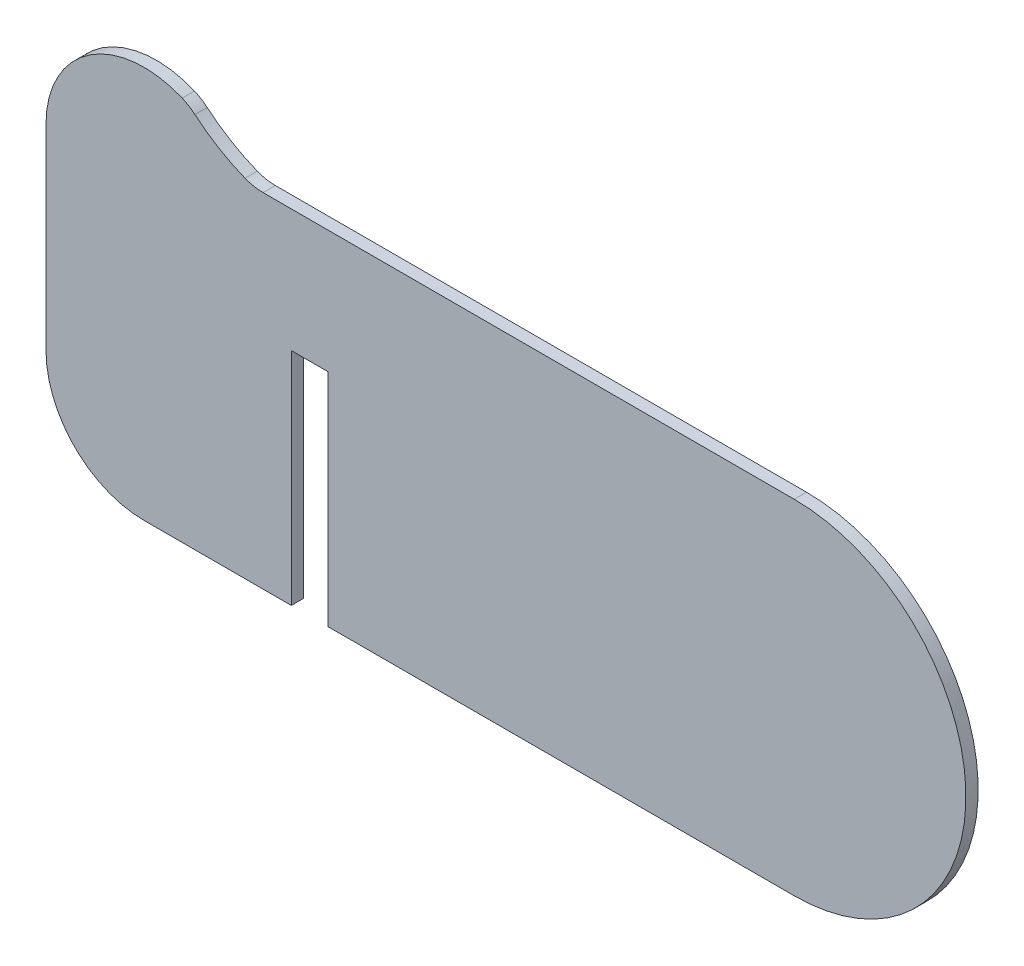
ISO-10303-21;
HEADER;
FILE_DESCRIPTION(('STEP AP214'),'2;1');
FILE_NAME('part.step','',(''),(''),'','','');
FILE_SCHEMA(('AUTOMOTIVE_DESIGN { 1 0 10303 214 1 1 1 1 }'));
ENDSEC;
DATA;
#1=APPLICATION_CONTEXT('core data for automotive mechanical design processes');
#2=APPLICATION_PROTOCOL_DEFINITION('international standard','automotive_design',2000,#1);
#3=PRODUCT_CONTEXT('',#1,'mechanical');
#4=PRODUCT('Part','Part','',(#3));
#5=PRODUCT_RELATED_PRODUCT_CATEGORY('part','',(#4));
#6=PRODUCT_DEFINITION_FORMATION('','',#4);
#7=PRODUCT_DEFINITION_CONTEXT('part definition',#1,'design');
#8=PRODUCT_DEFINITION('design','',#6,#7);
#9=PRODUCT_DEFINITION_SHAPE('','',#8);
#10=(LENGTH_UNIT() NAMED_UNIT(*) SI_UNIT(.MILLI.,.METRE.));
#11=(NAMED_UNIT(*) PLANE_ANGLE_UNIT() SI_UNIT($,.RADIAN.));
#12=(NAMED_UNIT(*) SI_UNIT($,.STERADIAN.) SOLID_ANGLE_UNIT());
#13=UNCERTAINTY_MEASURE_WITH_UNIT(LENGTH_MEASURE(1.E-05),#10,'distance_accuracy_value','');
#14=(GEOMETRIC_REPRESENTATION_CONTEXT(3) GLOBAL_UNCERTAINTY_ASSIGNED_CONTEXT((#13)) GLOBAL_UNIT_ASSIGNED_CONTEXT((#10,
#11,#12)) REPRESENTATION_CONTEXT('',''));
#15=CARTESIAN_POINT('',(0.,0.,0.));
#16=DIRECTION('',(0.,0.,1.));
#17=DIRECTION('',(1.,0.,0.));
#18=AXIS2_PLACEMENT_3D('',#15,#16,#17);
#19=CARTESIAN_POINT('',(-26.5,-2.,0.));
#20=DIRECTION('',(0.,0.,1.));
#21=DIRECTION('',(1.,0.,0.));
#22=AXIS2_PLACEMENT_3D('',#19,#20,#21);
#23=PLANE('',#22);
#24=DIRECTION('',(0.,1.,0.));
#25=VECTOR('',#24,1.);
#26=CARTESIAN_POINT('',(-19.,-5.,0.));
#27=LINE('',#26,#25);
#28=CARTESIAN_POINT('',(-19.,-14.,0.));
#29=VERTEX_POINT('',#28);
#30=CARTESIAN_POINT('',(-19.,-5.,0.));
#31=VERTEX_POINT('',#30);
#32=EDGE_CURVE('E156',#29,#31,#27,.T.);
#33=ORIENTED_EDGE('',*,*,#32,.T.);
#34=DIRECTION('',(1.,0.,0.));
#35=VECTOR('',#34,1.);
#36=CARTESIAN_POINT('',(-26.5,-5.,0.));
#37=LINE('',#36,#35);
#38=CARTESIAN_POINT('',(-20.5,-5.,0.));
#39=VERTEX_POINT('',#38);
#40=EDGE_CURVE('E158',#39,#31,#37,.T.);
#41=ORIENTED_EDGE('',*,*,#40,.F.);
#42=DIRECTION('',(0.,1.,0.));
#43=VECTOR('',#42,1.);
#44=CARTESIAN_POINT('',(-20.5,-5.,0.));
#45=LINE('',#44,#43);
#46=CARTESIAN_POINT('',(-20.5,-14.,0.));
#47=VERTEX_POINT('',#46);
#48=EDGE_CURVE('E164',#39,#47,#45,.F.);
#49=ORIENTED_EDGE('',*,*,#48,.T.);
#50=DIRECTION('',(-1.,0.,0.));
#51=VECTOR('',#50,1.);
#52=CARTESIAN_POINT('',(-26.5,-14.,0.));
#53=LINE('',#52,#51);
#54=CARTESIAN_POINT('',(-26.5,-14.,0.));
#55=VERTEX_POINT('',#54);
#56=EDGE_CURVE('E161',#47,#55,#53,.T.);
#57=ORIENTED_EDGE('',*,*,#56,.T.);
#58=CARTESIAN_POINT('',(-26.5,-10.,0.));
#59=DIRECTION('',(0.,0.,-1.));
#60=DIRECTION('',(-1.,0.,0.));
#61=AXIS2_PLACEMENT_3D('',#58,#59,#60);
#62=CIRCLE('',#61,4.);
#63=CARTESIAN_POINT('',(-30.5,-10.,0.));
#64=VERTEX_POINT('',#63);
#65=EDGE_CURVE('E179',#64,#55,#62,.F.);
#66=ORIENTED_EDGE('',*,*,#65,.F.);
#67=DIRECTION('',(0.,1.,0.));
#68=VECTOR('',#67,1.);
#69=CARTESIAN_POINT('',(-30.5,-2.,0.));
#70=LINE('',#69,#68);
#71=CARTESIAN_POINT('',(-30.5,-2.,0.));
#72=VERTEX_POINT('',#71);
#73=EDGE_CURVE('E177',#64,#72,#70,.T.);
#74=ORIENTED_EDGE('',*,*,#73,.T.);
#75=CARTESIAN_POINT('',(-26.5,-2.,0.));
#76=DIRECTION('',(0.,0.,-1.));
#77=DIRECTION('',(-1.,0.,0.));
#78=AXIS2_PLACEMENT_3D('',#75,#76,#77);
#79=CIRCLE('',#78,4.);
#80=CARTESIAN_POINT('',(-24.9499170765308,1.68744395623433,0.));
#81=VERTEX_POINT('',#80);
#82=EDGE_CURVE('E206',#81,#72,#79,.F.);
#83=ORIENTED_EDGE('',*,*,#82,.F.);
#84=CARTESIAN_POINT('',(-25.7249585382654,-0.156278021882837,0.));
#85=DIRECTION('',(0.,0.,-1.));
#86=DIRECTION('',(-1.,0.,0.));
#87=AXIS2_PLACEMENT_3D('',#84,#85,#86);
#88=CIRCLE('',#87,2.);
#89=CARTESIAN_POINT('',(-24.4292685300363,1.36726633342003,0.));
#90=VERTEX_POINT('',#89);
#91=EDGE_CURVE('E210',#90,#81,#88,.F.);
#92=ORIENTED_EDGE('',*,*,#91,.F.);
#93=CARTESIAN_POINT('',(-19.7,6.92820323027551,0.));
#94=DIRECTION('',(0.,0.,-1.));
#95=DIRECTION('',(-1.,0.,0.));
#96=AXIS2_PLACEMENT_3D('',#93,#94,#95);
#97=CIRCLE('',#96,7.3);
#98=CARTESIAN_POINT('',(-22.385959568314,0.140300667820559,0.));
#99=VERTEX_POINT('',#98);
#100=EDGE_CURVE('E213',#90,#99,#97,.F.);
#101=ORIENTED_EDGE('',*,*,#100,.T.);
#102=CARTESIAN_POINT('',(-21.6500802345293,2.,0.));
#103=DIRECTION('',(0.,0.,-1.));
#104=DIRECTION('',(-1.,0.,0.));
#105=AXIS2_PLACEMENT_3D('',#102,#103,#104);
#106=CIRCLE('',#105,2.);
#107=CARTESIAN_POINT('',(-21.6500802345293,0.,0.));
#108=VERTEX_POINT('',#107);
#109=EDGE_CURVE('E124',#99,#108,#106,.F.);
#110=ORIENTED_EDGE('',*,*,#109,.T.);
#111=DIRECTION('',(1.,0.,0.));
#112=VECTOR('',#111,1.);
#113=CARTESIAN_POINT('',(0.,0.,0.));
#114=LINE('',#113,#112);
#115=CARTESIAN_POINT('',(0.,0.,0.));
#116=VERTEX_POINT('',#115);
#117=EDGE_CURVE('E121',#108,#116,#114,.T.);
#118=ORIENTED_EDGE('',*,*,#117,.T.);
#119=CARTESIAN_POINT('',(0.,-7.,0.));
#120=DIRECTION('',(0.,0.,-1.));
#121=DIRECTION('',(-1.,0.,0.));
#122=AXIS2_PLACEMENT_3D('',#119,#120,#121);
#123=CIRCLE('',#122,7.);
#124=CARTESIAN_POINT('',(0.,-14.,0.));
#125=VERTEX_POINT('',#124);
#126=EDGE_CURVE('E20',#125,#116,#123,.F.);
#127=ORIENTED_EDGE('',*,*,#126,.F.);
#128=DIRECTION('',(-1.,0.,0.));
#129=VECTOR('',#128,1.);
#130=CARTESIAN_POINT('',(-26.5,-14.,0.));
#131=LINE('',#130,#129);
#132=EDGE_CURVE('E139',#125,#29,#131,.T.);
#133=ORIENTED_EDGE('',*,*,#132,.T.);
#134=EDGE_LOOP('',(#33,#41,#49,#57,#66,#74,#83,#92,#101,#110,#118,#127,#133));
#135=FACE_BOUND('',#134,.T.);
#136=ADVANCED_FACE('F17',(#135),#23,.F.);
#137=CARTESIAN_POINT('',(-19.,-5.,0.));
#138=DIRECTION('',(1.,0.,0.));
#139=DIRECTION('',(0.,0.,-1.));
#140=AXIS2_PLACEMENT_3D('',#137,#138,#139);
#141=PLANE('',#140);
#142=DIRECTION('',(0.,0.,1.));
#143=VECTOR('',#142,1.);
#144=CARTESIAN_POINT('',(-19.,-5.,0.));
#145=LINE('',#144,#143);
#146=CARTESIAN_POINT('',(-19.,-5.,0.5));
#147=VERTEX_POINT('',#146);
#148=EDGE_CURVE('E148',#147,#31,#145,.F.);
#149=ORIENTED_EDGE('',*,*,#148,.T.);
#150=ORIENTED_EDGE('',*,*,#32,.F.);
#151=DIRECTION('',(0.,0.,1.));
#152=VECTOR('',#151,1.);
#153=CARTESIAN_POINT('',(-19.,-14.,0.5));
#154=LINE('',#153,#152);
#155=CARTESIAN_POINT('',(-19.,-14.,0.5));
#156=VERTEX_POINT('',#155);
#157=EDGE_CURVE('E119',#29,#156,#154,.T.);
#158=ORIENTED_EDGE('',*,*,#157,.T.);
#159=DIRECTION('',(0.,1.,0.));
#160=VECTOR('',#159,1.);
#161=CARTESIAN_POINT('',(-19.,-2.,0.5));
#162=LINE('',#161,#160);
#163=EDGE_CURVE('E142',#147,#156,#162,.F.);
#164=ORIENTED_EDGE('',*,*,#163,.F.);
#165=EDGE_LOOP('',(#149,#150,#158,#164));
#166=FACE_BOUND('',#165,.T.);
#167=ADVANCED_FACE('F277',(#166),#141,.F.);
#168=CARTESIAN_POINT('',(-26.5,-14.,0.5));
#169=DIRECTION('',(0.,1.,0.));
#170=DIRECTION('',(-1.,0.,0.));
#171=AXIS2_PLACEMENT_3D('',#168,#169,#170);
#172=PLANE('',#171);
#173=ORIENTED_EDGE('',*,*,#157,.F.);
#174=ORIENTED_EDGE('',*,*,#132,.F.);
#175=DIRECTION('',(0.,0.,-1.));
#176=VECTOR('',#175,1.);
#177=CARTESIAN_POINT('',(0.,-14.,0.5));
#178=LINE('',#177,#176);
#179=CARTESIAN_POINT('',(0.,-14.,0.5));
#180=VERTEX_POINT('',#179);
#181=EDGE_CURVE('E118',#180,#125,#178,.T.);
#182=ORIENTED_EDGE('',*,*,#181,.F.);
#183=DIRECTION('',(1.,0.,0.));
#184=VECTOR('',#183,1.);
#185=CARTESIAN_POINT('',(-26.5,-14.,0.5));
#186=LINE('',#185,#184);
#187=EDGE_CURVE('E145',#156,#180,#186,.T.);
#188=ORIENTED_EDGE('',*,*,#187,.F.);
#189=EDGE_LOOP('',(#173,#174,#182,#188));
#190=FACE_BOUND('',#189,.T.);
#191=ADVANCED_FACE('F281',(#190),#172,.F.);
#192=CARTESIAN_POINT('',(0.,-7.,0.5));
#193=DIRECTION('',(0.,0.,-1.));
#194=DIRECTION('',(-1.,0.,0.));
#195=AXIS2_PLACEMENT_3D('',#192,#193,#194);
#196=CYLINDRICAL_SURFACE('',#195,7.);
#197=CARTESIAN_POINT('',(0.,-7.,0.5));
#198=DIRECTION('',(0.,0.,-1.));
#199=DIRECTION('',(-1.,0.,0.));
#200=AXIS2_PLACEMENT_3D('',#197,#198,#199);
#201=CIRCLE('',#200,7.);
#202=CARTESIAN_POINT('',(0.,0.,0.5));
#203=VERTEX_POINT('',#202);
#204=EDGE_CURVE('E202',#180,#203,#201,.F.);
#205=ORIENTED_EDGE('',*,*,#204,.F.);
#206=ORIENTED_EDGE('',*,*,#181,.T.);
#207=ORIENTED_EDGE('',*,*,#126,.T.);
#208=DIRECTION('',(0.,0.,1.));
#209=VECTOR('',#208,1.);
#210=CARTESIAN_POINT('',(0.,0.,0.5));
#211=LINE('',#210,#209);
#212=EDGE_CURVE('E116',#116,#203,#211,.T.);
#213=ORIENTED_EDGE('',*,*,#212,.T.);
#214=EDGE_LOOP('',(#205,#206,#207,#213));
#215=FACE_BOUND('',#214,.T.);
#216=ADVANCED_FACE('F114',(#215),#196,.T.);
#217=CARTESIAN_POINT('',(0.,0.,0.5));
#218=DIRECTION('',(0.,-1.,0.));
#219=DIRECTION('',(1.,0.,0.));
#220=AXIS2_PLACEMENT_3D('',#217,#218,#219);
#221=PLANE('',#220);
#222=DIRECTION('',(0.,0.,-1.));
#223=VECTOR('',#222,1.);
#224=CARTESIAN_POINT('',(-21.6500802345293,0.,0.5));
#225=LINE('',#224,#223);
#226=CARTESIAN_POINT('',(-21.6500802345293,0.,0.5));
#227=VERTEX_POINT('',#226);
#228=EDGE_CURVE('E127',#108,#227,#225,.F.);
#229=ORIENTED_EDGE('',*,*,#228,.T.);
#230=DIRECTION('',(1.,0.,0.));
#231=VECTOR('',#230,1.);
#232=CARTESIAN_POINT('',(-26.5,0.,0.5));
#233=LINE('',#232,#231);
#234=EDGE_CURVE('E131',#203,#227,#233,.F.);
#235=ORIENTED_EDGE('',*,*,#234,.F.);
#236=ORIENTED_EDGE('',*,*,#212,.F.);
#237=ORIENTED_EDGE('',*,*,#117,.F.);
#238=EDGE_LOOP('',(#229,#235,#236,#237));
#239=FACE_BOUND('',#238,.T.);
#240=ADVANCED_FACE('F129',(#239),#221,.F.);
#241=CARTESIAN_POINT('',(-21.6500802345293,2.,0.5));
#242=DIRECTION('',(0.,0.,-1.));
#243=DIRECTION('',(-1.,0.,0.));
#244=AXIS2_PLACEMENT_3D('',#241,#242,#243);
#245=CYLINDRICAL_SURFACE('',#244,2.);
#246=DIRECTION('',(0.,0.,-1.));
#247=VECTOR('',#246,1.);
#248=CARTESIAN_POINT('',(-22.385959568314,0.140300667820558,0.5));
#249=LINE('',#248,#247);
#250=CARTESIAN_POINT('',(-22.385959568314,0.140300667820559,0.5));
#251=VERTEX_POINT('',#250);
#252=EDGE_CURVE('E214',#99,#251,#249,.F.);
#253=ORIENTED_EDGE('',*,*,#252,.T.);
#254=CARTESIAN_POINT('',(-21.6500802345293,2.,0.5));
#255=DIRECTION('',(0.,0.,-1.));
#256=DIRECTION('',(-1.,0.,0.));
#257=AXIS2_PLACEMENT_3D('',#254,#255,#256);
#258=CIRCLE('',#257,2.);
#259=EDGE_CURVE('E199',#227,#251,#258,.T.);
#260=ORIENTED_EDGE('',*,*,#259,.F.);
#261=ORIENTED_EDGE('',*,*,#228,.F.);
#262=ORIENTED_EDGE('',*,*,#109,.F.);
#263=EDGE_LOOP('',(#253,#260,#261,#262));
#264=FACE_BOUND('',#263,.T.);
#265=ADVANCED_FACE('F217',(#264),#245,.F.);
#266=CARTESIAN_POINT('',(-19.7,6.92820323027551,0.5));
#267=DIRECTION('',(0.,0.,-1.));
#268=DIRECTION('',(-1.,0.,0.));
#269=AXIS2_PLACEMENT_3D('',#266,#267,#268);
#270=CYLINDRICAL_SURFACE('',#269,7.3);
#271=DIRECTION('',(0.,0.,-1.));
#272=VECTOR('',#271,1.);
#273=CARTESIAN_POINT('',(-24.4292685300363,1.36726633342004,0.5));
#274=LINE('',#273,#272);
#275=CARTESIAN_POINT('',(-24.4292685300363,1.36726633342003,0.5));
#276=VERTEX_POINT('',#275);
#277=EDGE_CURVE('E209',#276,#90,#274,.T.);
#278=ORIENTED_EDGE('',*,*,#277,.F.);
#279=CARTESIAN_POINT('',(-19.7,6.92820323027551,0.5));
#280=DIRECTION('',(0.,0.,-1.));
#281=DIRECTION('',(-1.,0.,0.));
#282=AXIS2_PLACEMENT_3D('',#279,#280,#281);
#283=CIRCLE('',#282,7.3);
#284=EDGE_CURVE('E196',#251,#276,#283,.T.);
#285=ORIENTED_EDGE('',*,*,#284,.F.);
#286=ORIENTED_EDGE('',*,*,#252,.F.);
#287=ORIENTED_EDGE('',*,*,#100,.F.);
#288=EDGE_LOOP('',(#278,#285,#286,#287));
#289=FACE_BOUND('',#288,.T.);
#290=ADVANCED_FACE('F249',(#289),#270,.F.);
#291=CARTESIAN_POINT('',(-25.7249585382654,-0.156278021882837,0.5));
#292=DIRECTION('',(0.,0.,-1.));
#293=DIRECTION('',(-1.,0.,0.));
#294=AXIS2_PLACEMENT_3D('',#291,#292,#293);
#295=CYLINDRICAL_SURFACE('',#294,2.);
#296=CARTESIAN_POINT('',(-25.7249585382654,-0.156278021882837,0.5));
#297=DIRECTION('',(0.,0.,-1.));
#298=DIRECTION('',(-1.,0.,0.));
#299=AXIS2_PLACEMENT_3D('',#296,#297,#298);
#300=CIRCLE('',#299,2.);
#301=CARTESIAN_POINT('',(-24.9499170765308,1.68744395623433,0.5));
#302=VERTEX_POINT('',#301);
#303=EDGE_CURVE('E193',#276,#302,#300,.F.);
#304=ORIENTED_EDGE('',*,*,#303,.F.);
#305=ORIENTED_EDGE('',*,*,#277,.T.);
#306=ORIENTED_EDGE('',*,*,#91,.T.);
#307=DIRECTION('',(0.,0.,-1.));
#308=VECTOR('',#307,1.);
#309=CARTESIAN_POINT('',(-24.9499170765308,1.68744395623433,0.5));
#310=LINE('',#309,#308);
#311=EDGE_CURVE('E208',#302,#81,#310,.T.);
#312=ORIENTED_EDGE('',*,*,#311,.F.);
#313=EDGE_LOOP('',(#304,#305,#306,#312));
#314=FACE_BOUND('',#313,.T.);
#315=ADVANCED_FACE('F246',(#314),#295,.T.);
#316=CARTESIAN_POINT('',(-26.5,-2.,0.5));
#317=DIRECTION('',(0.,0.,-1.));
#318=DIRECTION('',(-1.,0.,0.));
#319=AXIS2_PLACEMENT_3D('',#316,#317,#318);
#320=CYLINDRICAL_SURFACE('',#319,4.);
#321=CARTESIAN_POINT('',(-26.5,-2.,0.5));
#322=DIRECTION('',(0.,0.,-1.));
#323=DIRECTION('',(-1.,0.,0.));
#324=AXIS2_PLACEMENT_3D('',#321,#322,#323);
#325=CIRCLE('',#324,4.);
#326=CARTESIAN_POINT('',(-30.5,-2.,0.5));
#327=VERTEX_POINT('',#326);
#328=EDGE_CURVE('E190',#302,#327,#325,.F.);
#329=ORIENTED_EDGE('',*,*,#328,.F.);
#330=ORIENTED_EDGE('',*,*,#311,.T.);
#331=ORIENTED_EDGE('',*,*,#82,.T.);
#332=DIRECTION('',(0.,0.,-1.));
#333=VECTOR('',#332,1.);
#334=CARTESIAN_POINT('',(-30.5,-2.,0.5));
#335=LINE('',#334,#333);
#336=EDGE_CURVE('E180',#72,#327,#335,.F.);
#337=ORIENTED_EDGE('',*,*,#336,.T.);
#338=EDGE_LOOP('',(#329,#330,#331,#337));
#339=FACE_BOUND('',#338,.T.);
#340=ADVANCED_FACE('F254',(#339),#320,.T.);
#341=CARTESIAN_POINT('',(-30.5,-2.,0.5));
#342=DIRECTION('',(1.,0.,0.));
#343=DIRECTION('',(0.,0.,-1.));
#344=AXIS2_PLACEMENT_3D('',#341,#342,#343);
#345=PLANE('',#344);
#346=DIRECTION('',(0.,0.,-1.));
#347=VECTOR('',#346,1.);
#348=CARTESIAN_POINT('',(-30.5,-10.,0.5));
#349=LINE('',#348,#347);
#350=CARTESIAN_POINT('',(-30.5,-10.,0.5));
#351=VERTEX_POINT('',#350);
#352=EDGE_CURVE('E205',#351,#64,#349,.T.);
#353=ORIENTED_EDGE('',*,*,#352,.F.);
#354=DIRECTION('',(0.,1.,0.));
#355=VECTOR('',#354,1.);
#356=CARTESIAN_POINT('',(-30.5,-2.,0.5));
#357=LINE('',#356,#355);
#358=EDGE_CURVE('E189',#327,#351,#357,.F.);
#359=ORIENTED_EDGE('',*,*,#358,.F.);
#360=ORIENTED_EDGE('',*,*,#336,.F.);
#361=ORIENTED_EDGE('',*,*,#73,.F.);
#362=EDGE_LOOP('',(#353,#359,#360,#361));
#363=FACE_BOUND('',#362,.T.);
#364=ADVANCED_FACE('F260',(#363),#345,.F.);
#365=CARTESIAN_POINT('',(-26.5,-10.,0.5));
#366=DIRECTION('',(0.,0.,-1.));
#367=DIRECTION('',(-1.,0.,0.));
#368=AXIS2_PLACEMENT_3D('',#365,#366,#367);
#369=CYLINDRICAL_SURFACE('',#368,4.);
#370=CARTESIAN_POINT('',(-26.5,-10.,0.5));
#371=DIRECTION('',(0.,0.,-1.));
#372=DIRECTION('',(-1.,0.,0.));
#373=AXIS2_PLACEMENT_3D('',#370,#371,#372);
#374=CIRCLE('',#373,4.);
#375=CARTESIAN_POINT('',(-26.5,-14.,0.5));
#376=VERTEX_POINT('',#375);
#377=EDGE_CURVE('E185',#351,#376,#374,.F.);
#378=ORIENTED_EDGE('',*,*,#377,.F.);
#379=ORIENTED_EDGE('',*,*,#352,.T.);
#380=ORIENTED_EDGE('',*,*,#65,.T.);
#381=DIRECTION('',(0.,0.,1.));
#382=VECTOR('',#381,1.);
#383=CARTESIAN_POINT('',(-26.5,-14.,0.5));
#384=LINE('',#383,#382);
#385=EDGE_CURVE('E165',#55,#376,#384,.T.);
#386=ORIENTED_EDGE('',*,*,#385,.T.);
#387=EDGE_LOOP('',(#378,#379,#380,#386));
#388=FACE_BOUND('',#387,.T.);
#389=ADVANCED_FACE('F262',(#388),#369,.T.);
#390=CARTESIAN_POINT('',(-26.5,-14.,0.5));
#391=DIRECTION('',(0.,1.,0.));
#392=DIRECTION('',(-1.,0.,0.));
#393=AXIS2_PLACEMENT_3D('',#390,#391,#392);
#394=PLANE('',#393);
#395=DIRECTION('',(0.,0.,1.));
#396=VECTOR('',#395,1.);
#397=CARTESIAN_POINT('',(-20.5,-14.,0.));
#398=LINE('',#397,#396);
#399=CARTESIAN_POINT('',(-20.5,-14.,0.5));
#400=VERTEX_POINT('',#399);
#401=EDGE_CURVE('E151',#47,#400,#398,.T.);
#402=ORIENTED_EDGE('',*,*,#401,.T.);
#403=DIRECTION('',(1.,0.,0.));
#404=VECTOR('',#403,1.);
#405=CARTESIAN_POINT('',(-26.5,-14.,0.5));
#406=LINE('',#405,#404);
#407=EDGE_CURVE('E188',#376,#400,#406,.T.);
#408=ORIENTED_EDGE('',*,*,#407,.F.);
#409=ORIENTED_EDGE('',*,*,#385,.F.);
#410=ORIENTED_EDGE('',*,*,#56,.F.);
#411=EDGE_LOOP('',(#402,#408,#409,#410));
#412=FACE_BOUND('',#411,.T.);
#413=ADVANCED_FACE('F267',(#412),#394,.F.);
#414=CARTESIAN_POINT('',(-20.5,-5.,0.));
#415=DIRECTION('',(-1.,0.,0.));
#416=DIRECTION('',(0.,0.,1.));
#417=AXIS2_PLACEMENT_3D('',#414,#415,#416);
#418=PLANE('',#417);
#419=ORIENTED_EDGE('',*,*,#401,.F.);
#420=ORIENTED_EDGE('',*,*,#48,.F.);
#421=DIRECTION('',(0.,0.,1.));
#422=VECTOR('',#421,1.);
#423=CARTESIAN_POINT('',(-20.5,-5.,0.));
#424=LINE('',#423,#422);
#425=CARTESIAN_POINT('',(-20.5,-5.,0.5));
#426=VERTEX_POINT('',#425);
#427=EDGE_CURVE('E35',#39,#426,#424,.T.);
#428=ORIENTED_EDGE('',*,*,#427,.T.);
#429=DIRECTION('',(0.,1.,0.));
#430=VECTOR('',#429,1.);
#431=CARTESIAN_POINT('',(-20.5,-2.,0.5));
#432=LINE('',#431,#430);
#433=EDGE_CURVE('E26',#400,#426,#432,.T.);
#434=ORIENTED_EDGE('',*,*,#433,.F.);
#435=EDGE_LOOP('',(#419,#420,#428,#434));
#436=FACE_BOUND('',#435,.T.);
#437=ADVANCED_FACE('F271',(#436),#418,.F.);
#438=CARTESIAN_POINT('',(-20.5,-5.,0.));
#439=DIRECTION('',(0.,1.,0.));
#440=DIRECTION('',(0.,0.,1.));
#441=AXIS2_PLACEMENT_3D('',#438,#439,#440);
#442=PLANE('',#441);
#443=ORIENTED_EDGE('',*,*,#427,.F.);
#444=ORIENTED_EDGE('',*,*,#40,.T.);
#445=ORIENTED_EDGE('',*,*,#148,.F.);
#446=DIRECTION('',(1.,0.,0.));
#447=VECTOR('',#446,1.);
#448=CARTESIAN_POINT('',(-26.5,-5.,0.5));
#449=LINE('',#448,#447);
#450=EDGE_CURVE('E11',#426,#147,#449,.T.);
#451=ORIENTED_EDGE('',*,*,#450,.F.);
#452=EDGE_LOOP('',(#443,#444,#445,#451));
#453=FACE_BOUND('',#452,.T.);
#454=ADVANCED_FACE('F273',(#453),#442,.F.);
#455=CARTESIAN_POINT('',(-26.5,-2.,0.5));
#456=DIRECTION('',(0.,0.,1.));
#457=DIRECTION('',(1.,0.,0.));
#458=AXIS2_PLACEMENT_3D('',#455,#456,#457);
#459=PLANE('',#458);
#460=ORIENTED_EDGE('',*,*,#433,.T.);
#461=ORIENTED_EDGE('',*,*,#450,.T.);
#462=ORIENTED_EDGE('',*,*,#163,.T.);
#463=ORIENTED_EDGE('',*,*,#187,.T.);
#464=ORIENTED_EDGE('',*,*,#204,.T.);
#465=ORIENTED_EDGE('',*,*,#234,.T.);
#466=ORIENTED_EDGE('',*,*,#259,.T.);
#467=ORIENTED_EDGE('',*,*,#284,.T.);
#468=ORIENTED_EDGE('',*,*,#303,.T.);
#469=ORIENTED_EDGE('',*,*,#328,.T.);
#470=ORIENTED_EDGE('',*,*,#358,.T.);
#471=ORIENTED_EDGE('',*,*,#377,.T.);
#472=ORIENTED_EDGE('',*,*,#407,.T.);
#473=EDGE_LOOP('',(#460,#461,#462,#463,#464,#465,#466,#467,#468,#469,#470,#471,#472));
#474=FACE_BOUND('',#473,.T.);
#475=ADVANCED_FACE('F222',(#474),#459,.T.);
#476=CLOSED_SHELL('',(#136,#167,#191,#216,#240,#265,#290,#315,#340,#364,#389,#413,#437,#454,#475));
#477=MANIFOLD_SOLID_BREP('B1',#476);
#478=ADVANCED_BREP_SHAPE_REPRESENTATION('',(#18,#477),#14);
#479=SHAPE_DEFINITION_REPRESENTATION(#9,#478);
ENDSEC;
END-ISO-10303-21;
